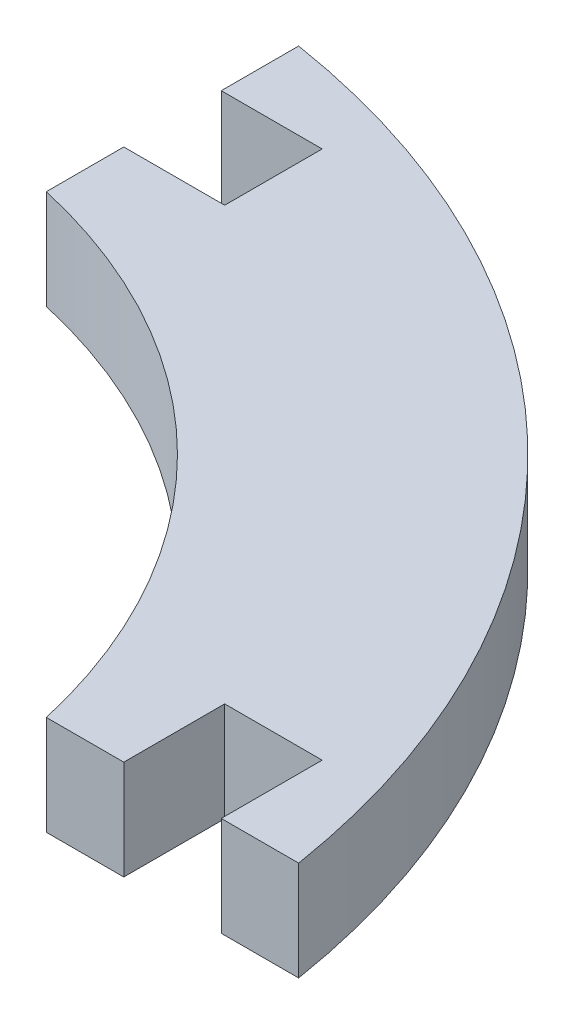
from build123d import *

# Parameters (mm, degrees)
BOSS_EXTRUDE1_DEPTH = 6.2611


with BuildPart() as part:
    # Sketch1 → Boss-Extrude1 (new body)
    with BuildSketch(Plane(origin=(0, 0, 0), x_dir=(1, 0, 0), z_dir=(0, 1, 0))):
        with BuildLine():
            Line((19.16147958, 0), (14.29102958, 0))
            ThreePointArc((14.29102958, 0), (4.089580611, 18.451616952), (-14.36203634, 28.65306592))
            Line((-14.36203634, 28.65306592), (-14.36203634, 33.52351592))
            Line((-14.36203634, 33.52351592), (-8.01203634, 33.52351592))
            Line((-8.01203634, 33.52351592), (-8.01203634, 39.65761592))
            Line((-8.01203634, 39.65761592), (-14.36203634, 39.65761592))
            Line((-14.36203634, 39.65761592), (-14.36203634, 44.52806592))
            ThreePointArc((-14.36203634, 44.52806592), (15.115185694, 29.477222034), (30.16602958, 0))
            Line((30.16602958, 0), (25.29557958, 0))
            Line((25.29557958, 0), (25.29557958, 6.35))
            Line((25.29557958, 6.35), (19.16147958, 6.35))
            Line((19.16147958, 6.35), (19.16147958, 0))
        make_face()
    extrude(amount=BOSS_EXTRUDE1_DEPTH)


solid = part.part
